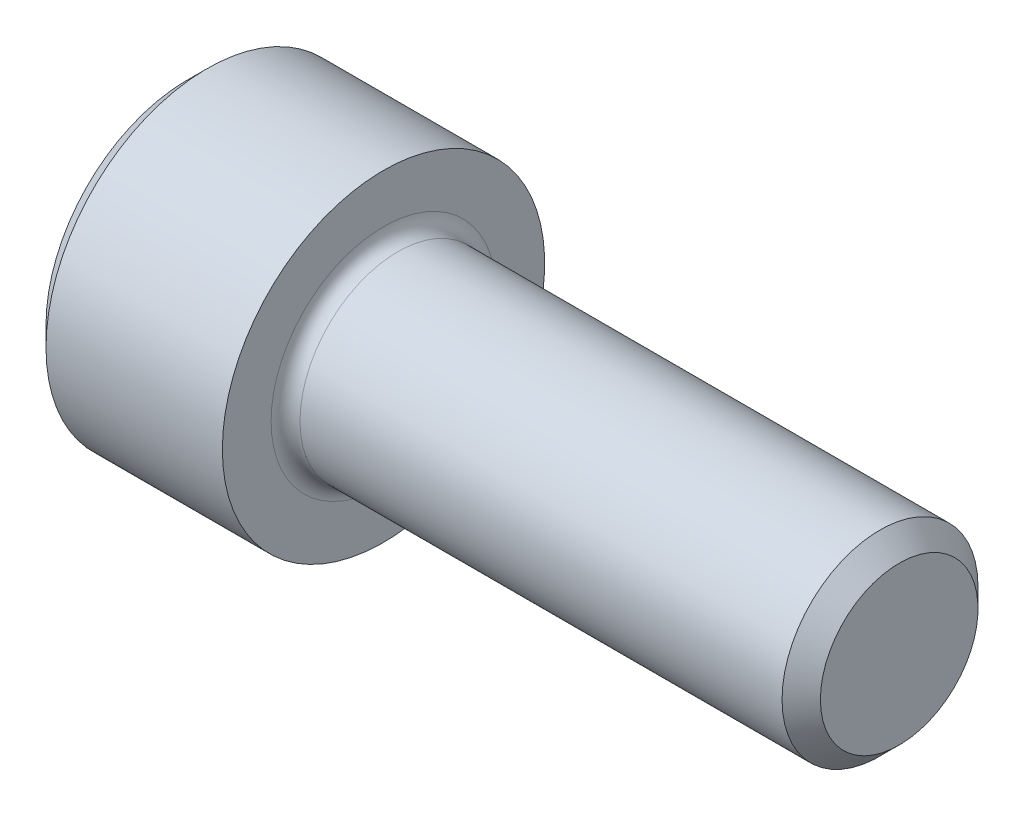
from build123d import *

# Parameters (mm, degrees)
FILLET1_R   = 0.3556
HEX_2_DEPTH = 2.286


with BuildPart() as part:
    # BodySke → Base-Revolve (revolve)
    with BuildSketch(Plane.XY, mode=Mode.PRIVATE) as base_revolve_sk:
        Polygon((0, 0), (0, 3.48615), (0.4826, 3.96875), (4.826, 3.96875), (4.826, 2.413), (17.05356, 2.413), (17.526, 1.94056), (17.526, 0), align=None)
    revolve(base_revolve_sk.sketch.rotate(Axis((-31.75, 0, 0), (1, 0, 0)), 90), axis=Axis((-31.75, 0, 0), (1, 0, 0)))

    # Fillet1
    fillet1_edges = [part.edges().sort_by_distance(p)[0] for p in [
        (4.826, 0, -2.413),
    ]]
    fillet(fillet1_edges, radius=FILLET1_R)

    # Sketch2 → Hex-PreBroach (revolve, cut)
    with BuildSketch(Plane.XY, mode=Mode.PRIVATE) as hex_prebroach_sk:
        Polygon((0, 1.98501), (2.286, 1.98501), (3.432046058, 0), (0, 0), align=None)
    revolve(hex_prebroach_sk.sketch.rotate(Axis((0, 0, 0), (1, 0, 0)), 90), axis=Axis((0, 0, 0), (1, 0, 0)), mode=Mode.SUBTRACT)

    # Sketch3 → Hex 2 (cut)
    with BuildSketch(Plane(origin=(0, 0, 0), x_dir=(0, 0.500000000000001, 0.866025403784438), z_dir=(-1, 0, 0))):
        Polygon((1.146046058, 1.98501), (-1.146046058, 1.98501), (-2.292092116, 0), (-1.146046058, -1.98501), (1.146046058, -1.98501), (2.292092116, 0), align=None)
    extrude(amount=-HEX_2_DEPTH, mode=Mode.SUBTRACT)


solid = part.part
